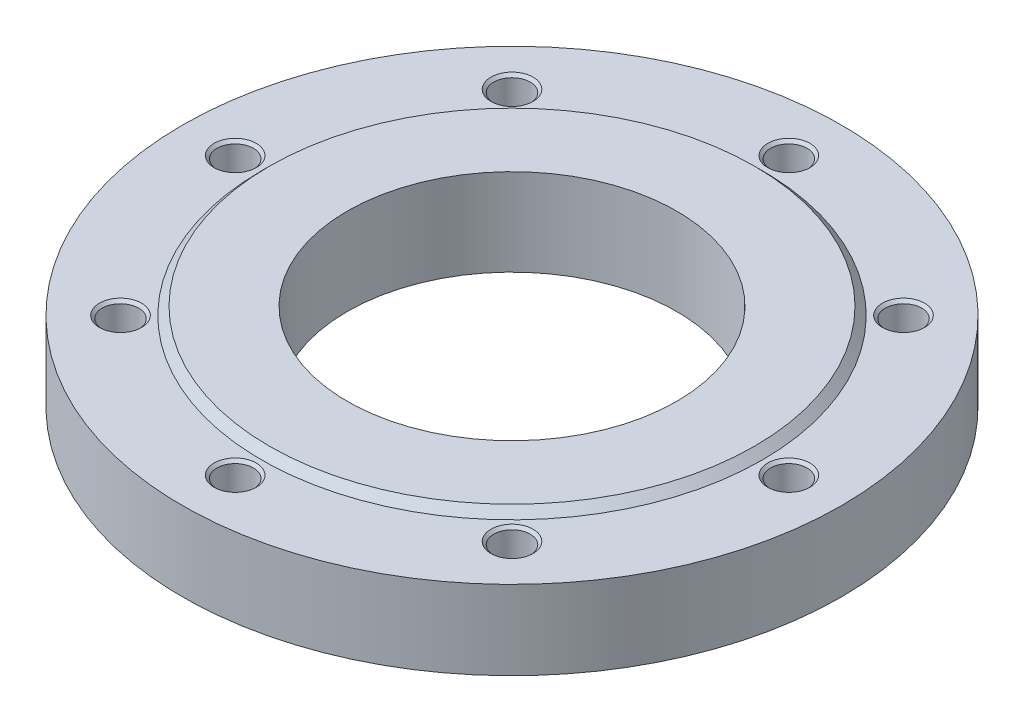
ISO-10303-21;
HEADER;
FILE_DESCRIPTION(('STEP AP214'),'2;1');
FILE_NAME('part.step','',(''),(''),'','','');
FILE_SCHEMA(('AUTOMOTIVE_DESIGN { 1 0 10303 214 1 1 1 1 }'));
ENDSEC;
DATA;
#1=APPLICATION_CONTEXT('core data for automotive mechanical design processes');
#2=APPLICATION_PROTOCOL_DEFINITION('international standard','automotive_design',2000,#1);
#3=PRODUCT_CONTEXT('',#1,'mechanical');
#4=PRODUCT('Part','Part','',(#3));
#5=PRODUCT_RELATED_PRODUCT_CATEGORY('part','',(#4));
#6=PRODUCT_DEFINITION_FORMATION('','',#4);
#7=PRODUCT_DEFINITION_CONTEXT('part definition',#1,'design');
#8=PRODUCT_DEFINITION('design','',#6,#7);
#9=PRODUCT_DEFINITION_SHAPE('','',#8);
#10=(LENGTH_UNIT() NAMED_UNIT(*) SI_UNIT(.MILLI.,.METRE.));
#11=(NAMED_UNIT(*) PLANE_ANGLE_UNIT() SI_UNIT($,.RADIAN.));
#12=(NAMED_UNIT(*) SI_UNIT($,.STERADIAN.) SOLID_ANGLE_UNIT());
#13=UNCERTAINTY_MEASURE_WITH_UNIT(LENGTH_MEASURE(1.E-05),#10,'distance_accuracy_value','');
#14=(GEOMETRIC_REPRESENTATION_CONTEXT(3) GLOBAL_UNCERTAINTY_ASSIGNED_CONTEXT((#13)) GLOBAL_UNIT_ASSIGNED_CONTEXT((#10,
#11,#12)) REPRESENTATION_CONTEXT('',''));
#15=CARTESIAN_POINT('',(0.,0.,0.));
#16=DIRECTION('',(0.,0.,1.));
#17=DIRECTION('',(1.,0.,0.));
#18=AXIS2_PLACEMENT_3D('',#15,#16,#17);
#19=CARTESIAN_POINT('',(0.,15.,0.));
#20=DIRECTION('',(0.,-1.,0.));
#21=DIRECTION('',(1.,0.,0.));
#22=AXIS2_PLACEMENT_3D('',#19,#20,#21);
#23=CYLINDRICAL_SURFACE('',#22,125.);
#24=CARTESIAN_POINT('',(0.,0.,0.));
#25=DIRECTION('',(0.,1.,0.));
#26=DIRECTION('',(1.,0.,0.));
#27=AXIS2_PLACEMENT_3D('',#24,#25,#26);
#28=CIRCLE('',#27,125.);
#29=CARTESIAN_POINT('',(125.,0.,0.));
#30=VERTEX_POINT('',#29);
#31=EDGE_CURVE('E9',#30,#30,#28,.T.);
#32=ORIENTED_EDGE('',*,*,#31,.T.);
#33=EDGE_LOOP('',(#32));
#34=FACE_BOUND('',#33,.T.);
#35=CARTESIAN_POINT('',(0.,30.,0.));
#36=DIRECTION('',(0.,1.,0.));
#37=DIRECTION('',(1.,0.,0.));
#38=AXIS2_PLACEMENT_3D('',#35,#36,#37);
#39=CIRCLE('',#38,125.);
#40=CARTESIAN_POINT('',(125.,30.,0.));
#41=VERTEX_POINT('',#40);
#42=EDGE_CURVE('E313',#41,#41,#39,.T.);
#43=ORIENTED_EDGE('',*,*,#42,.F.);
#44=EDGE_LOOP('',(#43));
#45=FACE_BOUND('',#44,.T.);
#46=ADVANCED_FACE('F15',(#34,#45),#23,.T.);
#47=CARTESIAN_POINT('',(93.75,0.,0.));
#48=DIRECTION('',(0.,-1.,0.));
#49=DIRECTION('',(-1.,0.,0.));
#50=AXIS2_PLACEMENT_3D('',#47,#48,#49);
#51=PLANE('',#50);
#52=CARTESIAN_POINT('',(0.,0.,0.));
#53=DIRECTION('',(0.,1.,0.));
#54=DIRECTION('',(1.,0.,0.));
#55=AXIS2_PLACEMENT_3D('',#52,#53,#54);
#56=CIRCLE('',#55,62.5);
#57=CARTESIAN_POINT('',(62.5,0.,0.));
#58=VERTEX_POINT('',#57);
#59=EDGE_CURVE('E22',#58,#58,#56,.T.);
#60=ORIENTED_EDGE('',*,*,#59,.T.);
#61=EDGE_LOOP('',(#60));
#62=FACE_BOUND('',#61,.T.);
#63=ORIENTED_EDGE('',*,*,#31,.F.);
#64=EDGE_LOOP('',(#63));
#65=FACE_BOUND('',#64,.T.);
#66=ADVANCED_FACE('F335',(#62,#65),#51,.T.);
#67=CARTESIAN_POINT('',(0.,16.5,0.));
#68=DIRECTION('',(0.,-1.,0.));
#69=DIRECTION('',(1.,0.,0.));
#70=AXIS2_PLACEMENT_3D('',#67,#68,#69);
#71=CYLINDRICAL_SURFACE('',#70,62.5);
#72=CARTESIAN_POINT('',(0.,33.,0.));
#73=DIRECTION('',(0.,1.,0.));
#74=DIRECTION('',(1.,0.,0.));
#75=AXIS2_PLACEMENT_3D('',#72,#73,#74);
#76=CIRCLE('',#75,62.5);
#77=CARTESIAN_POINT('',(62.5,33.,0.));
#78=VERTEX_POINT('',#77);
#79=EDGE_CURVE('E317',#78,#78,#76,.T.);
#80=ORIENTED_EDGE('',*,*,#79,.T.);
#81=EDGE_LOOP('',(#80));
#82=FACE_BOUND('',#81,.T.);
#83=ORIENTED_EDGE('',*,*,#59,.F.);
#84=EDGE_LOOP('',(#83));
#85=FACE_BOUND('',#84,.T.);
#86=ADVANCED_FACE('F320',(#82,#85),#71,.F.);
#87=CARTESIAN_POINT('',(77.25,33.,0.));
#88=DIRECTION('',(0.,1.,0.));
#89=DIRECTION('',(1.,0.,0.));
#90=AXIS2_PLACEMENT_3D('',#87,#88,#89);
#91=PLANE('',#90);
#92=CARTESIAN_POINT('',(0.,33.,0.));
#93=DIRECTION('',(0.,1.,0.));
#94=DIRECTION('',(1.,0.,0.));
#95=AXIS2_PLACEMENT_3D('',#92,#93,#94);
#96=CIRCLE('',#95,92.);
#97=CARTESIAN_POINT('',(92.,33.,0.));
#98=VERTEX_POINT('',#97);
#99=EDGE_CURVE('E315',#98,#98,#96,.T.);
#100=ORIENTED_EDGE('',*,*,#99,.T.);
#101=EDGE_LOOP('',(#100));
#102=FACE_BOUND('',#101,.T.);
#103=ORIENTED_EDGE('',*,*,#79,.F.);
#104=EDGE_LOOP('',(#103));
#105=FACE_BOUND('',#104,.T.);
#106=ADVANCED_FACE('F323',(#102,#105),#91,.T.);
#107=CARTESIAN_POINT('',(0.,31.5,0.));
#108=DIRECTION('',(0.,-1.,0.));
#109=DIRECTION('',(1.,0.,0.));
#110=AXIS2_PLACEMENT_3D('',#107,#108,#109);
#111=CONICAL_SURFACE('',#110,93.5,0.785398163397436);
#112=CARTESIAN_POINT('',(0.,30.,0.));
#113=DIRECTION('',(0.,1.,0.));
#114=DIRECTION('',(1.,0.,0.));
#115=AXIS2_PLACEMENT_3D('',#112,#113,#114);
#116=CIRCLE('',#115,95.);
#117=CARTESIAN_POINT('',(95.,30.,0.));
#118=VERTEX_POINT('',#117);
#119=EDGE_CURVE('E289',#118,#118,#116,.T.);
#120=ORIENTED_EDGE('',*,*,#119,.T.);
#121=EDGE_LOOP('',(#120));
#122=FACE_BOUND('',#121,.T.);
#123=ORIENTED_EDGE('',*,*,#99,.F.);
#124=EDGE_LOOP('',(#123));
#125=FACE_BOUND('',#124,.T.);
#126=ADVANCED_FACE('F325',(#122,#125),#111,.T.);
#127=CARTESIAN_POINT('',(110.,30.,0.));
#128=DIRECTION('',(0.,1.,0.));
#129=DIRECTION('',(1.,0.,0.));
#130=AXIS2_PLACEMENT_3D('',#127,#128,#129);
#131=PLANE('',#130);
#132=ORIENTED_EDGE('',*,*,#42,.T.);
#133=EDGE_LOOP('',(#132));
#134=FACE_BOUND('',#133,.T.);
#135=ORIENTED_EDGE('',*,*,#119,.F.);
#136=EDGE_LOOP('',(#135));
#137=FACE_BOUND('',#136,.T.);
#138=CARTESIAN_POINT('',(105.,30.,0.));
#139=DIRECTION('',(0.,-1.,0.));
#140=DIRECTION('',(1.,0.,0.));
#141=AXIS2_PLACEMENT_3D('',#138,#139,#140);
#142=CIRCLE('',#141,8.);
#143=CARTESIAN_POINT('',(113.,30.,0.));
#144=VERTEX_POINT('',#143);
#145=EDGE_CURVE('E280',#144,#144,#142,.T.);
#146=ORIENTED_EDGE('',*,*,#145,.T.);
#147=EDGE_LOOP('',(#146));
#148=FACE_BOUND('',#147,.T.);
#149=CARTESIAN_POINT('',(74.2462120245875,30.,-74.2462120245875));
#150=DIRECTION('',(0.,-1.,0.));
#151=DIRECTION('',(0.707106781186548,0.,-0.707106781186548));
#152=AXIS2_PLACEMENT_3D('',#149,#150,#151);
#153=CIRCLE('',#152,8.);
#154=CARTESIAN_POINT('',(79.9030662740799,30.,-79.9030662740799));
#155=VERTEX_POINT('',#154);
#156=EDGE_CURVE('E225',#155,#155,#153,.T.);
#157=ORIENTED_EDGE('',*,*,#156,.T.);
#158=EDGE_LOOP('',(#157));
#159=FACE_BOUND('',#158,.T.);
#160=CARTESIAN_POINT('',(0.,30.,-105.));
#161=DIRECTION('',(0.,-1.,0.));
#162=DIRECTION('',(0.,0.,-1.));
#163=AXIS2_PLACEMENT_3D('',#160,#161,#162);
#164=CIRCLE('',#163,8.);
#165=CARTESIAN_POINT('',(0.,30.,-113.));
#166=VERTEX_POINT('',#165);
#167=EDGE_CURVE('E251',#166,#166,#164,.T.);
#168=ORIENTED_EDGE('',*,*,#167,.T.);
#169=EDGE_LOOP('',(#168));
#170=FACE_BOUND('',#169,.T.);
#171=CARTESIAN_POINT('',(-74.2462120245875,30.,-74.2462120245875));
#172=DIRECTION('',(0.,-1.,0.));
#173=DIRECTION('',(-0.707106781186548,0.,-0.707106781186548));
#174=AXIS2_PLACEMENT_3D('',#171,#172,#173);
#175=CIRCLE('',#174,8.);
#176=CARTESIAN_POINT('',(-79.9030662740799,30.,-79.9030662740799));
#177=VERTEX_POINT('',#176);
#178=EDGE_CURVE('E279',#177,#177,#175,.T.);
#179=ORIENTED_EDGE('',*,*,#178,.T.);
#180=EDGE_LOOP('',(#179));
#181=FACE_BOUND('',#180,.T.);
#182=CARTESIAN_POINT('',(-105.,30.,0.));
#183=DIRECTION('',(0.,-1.,0.));
#184=DIRECTION('',(-1.,0.,0.));
#185=AXIS2_PLACEMENT_3D('',#182,#183,#184);
#186=CIRCLE('',#185,8.);
#187=CARTESIAN_POINT('',(-113.,30.,0.));
#188=VERTEX_POINT('',#187);
#189=EDGE_CURVE('E263',#188,#188,#186,.T.);
#190=ORIENTED_EDGE('',*,*,#189,.T.);
#191=EDGE_LOOP('',(#190));
#192=FACE_BOUND('',#191,.T.);
#193=CARTESIAN_POINT('',(-74.2462120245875,30.,74.2462120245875));
#194=DIRECTION('',(0.,-1.,0.));
#195=DIRECTION('',(-0.707106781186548,0.,0.707106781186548));
#196=AXIS2_PLACEMENT_3D('',#193,#194,#195);
#197=CIRCLE('',#196,8.);
#198=CARTESIAN_POINT('',(-79.9030662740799,30.,79.9030662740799));
#199=VERTEX_POINT('',#198);
#200=EDGE_CURVE('E234',#199,#199,#197,.T.);
#201=ORIENTED_EDGE('',*,*,#200,.T.);
#202=EDGE_LOOP('',(#201));
#203=FACE_BOUND('',#202,.T.);
#204=CARTESIAN_POINT('',(0.,30.,105.));
#205=DIRECTION('',(0.,-1.,0.));
#206=DIRECTION('',(0.,0.,1.));
#207=AXIS2_PLACEMENT_3D('',#204,#205,#206);
#208=CIRCLE('',#207,8.);
#209=CARTESIAN_POINT('',(0.,30.,113.));
#210=VERTEX_POINT('',#209);
#211=EDGE_CURVE('E211',#210,#210,#208,.T.);
#212=ORIENTED_EDGE('',*,*,#211,.T.);
#213=EDGE_LOOP('',(#212));
#214=FACE_BOUND('',#213,.T.);
#215=CARTESIAN_POINT('',(74.2462120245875,30.,74.2462120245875));
#216=DIRECTION('',(0.,-1.,0.));
#217=DIRECTION('',(0.707106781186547,0.,0.707106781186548));
#218=AXIS2_PLACEMENT_3D('',#215,#216,#217);
#219=CIRCLE('',#218,8.);
#220=CARTESIAN_POINT('',(79.9030662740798,30.,79.9030662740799));
#221=VERTEX_POINT('',#220);
#222=EDGE_CURVE('E231',#221,#221,#219,.T.);
#223=ORIENTED_EDGE('',*,*,#222,.T.);
#224=EDGE_LOOP('',(#223));
#225=FACE_BOUND('',#224,.T.);
#226=ADVANCED_FACE('F212',(#134,#137,#148,#159,#170,#181,#192,#203,#214,#225),#131,.T.);
#227=CARTESIAN_POINT('',(105.,5.00308975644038,0.));
#228=DIRECTION('',(0.,1.,0.));
#229=DIRECTION('',(1.,0.,0.));
#230=AXIS2_PLACEMENT_3D('',#227,#228,#229);
#231=CONICAL_SURFACE('',#230,3.45875,1.0471975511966);
#232=CARTESIAN_POINT('',(105.,7.,0.));
#233=DIRECTION('',(0.,-1.,0.));
#234=DIRECTION('',(1.,0.,0.));
#235=AXIS2_PLACEMENT_3D('',#232,#233,#234);
#236=CIRCLE('',#235,6.9175);
#237=CARTESIAN_POINT('',(111.9175,7.,0.));
#238=VERTEX_POINT('',#237);
#239=EDGE_CURVE('E287',#238,#238,#236,.T.);
#240=ORIENTED_EDGE('',*,*,#239,.F.);
#241=EDGE_LOOP('',(#240));
#242=FACE_BOUND('',#241,.T.);
#243=CARTESIAN_POINT('',(105.,3.00617951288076,0.));
#244=VERTEX_POINT('',#243);
#245=VERTEX_LOOP('',#244);
#246=FACE_BOUND('',#245,.T.);
#247=ADVANCED_FACE('F346',(#242,#246),#231,.F.);
#248=CARTESIAN_POINT('',(105.,9.95875,0.));
#249=DIRECTION('',(0.,1.,0.));
#250=DIRECTION('',(1.,0.,0.));
#251=AXIS2_PLACEMENT_3D('',#248,#249,#250);
#252=CYLINDRICAL_SURFACE('',#251,6.9175);
#253=CARTESIAN_POINT('',(105.,12.9175,0.));
#254=DIRECTION('',(0.,-1.,0.));
#255=DIRECTION('',(1.,0.,0.));
#256=AXIS2_PLACEMENT_3D('',#253,#254,#255);
#257=CIRCLE('',#256,6.9175);
#258=CARTESIAN_POINT('',(111.9175,12.9175,0.));
#259=VERTEX_POINT('',#258);
#260=EDGE_CURVE('E290',#259,#259,#257,.T.);
#261=ORIENTED_EDGE('',*,*,#260,.F.);
#262=EDGE_LOOP('',(#261));
#263=FACE_BOUND('',#262,.T.);
#264=ORIENTED_EDGE('',*,*,#239,.T.);
#265=EDGE_LOOP('',(#264));
#266=FACE_BOUND('',#265,.T.);
#267=ADVANCED_FACE('F453',(#263,#266),#252,.F.);
#268=CARTESIAN_POINT('',(105.,13.45875,0.));
#269=DIRECTION('',(0.,1.,0.));
#270=DIRECTION('',(1.,0.,0.));
#271=AXIS2_PLACEMENT_3D('',#268,#269,#270);
#272=CONICAL_SURFACE('',#271,7.45875,0.785398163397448);
#273=CARTESIAN_POINT('',(105.,14.,0.));
#274=DIRECTION('',(0.,-1.,0.));
#275=DIRECTION('',(1.,0.,0.));
#276=AXIS2_PLACEMENT_3D('',#273,#274,#275);
#277=CIRCLE('',#276,8.);
#278=CARTESIAN_POINT('',(113.,14.,0.));
#279=VERTEX_POINT('',#278);
#280=EDGE_CURVE('E309',#279,#279,#277,.T.);
#281=ORIENTED_EDGE('',*,*,#280,.F.);
#282=EDGE_LOOP('',(#281));
#283=FACE_BOUND('',#282,.T.);
#284=ORIENTED_EDGE('',*,*,#260,.T.);
#285=EDGE_LOOP('',(#284));
#286=FACE_BOUND('',#285,.T.);
#287=ADVANCED_FACE('F456',(#283,#286),#272,.F.);
#288=CARTESIAN_POINT('',(112.45875,14.,0.));
#289=DIRECTION('',(0.,1.,0.));
#290=DIRECTION('',(-1.,0.,0.));
#291=AXIS2_PLACEMENT_3D('',#288,#289,#290);
#292=PLANE('',#291);
#293=CARTESIAN_POINT('',(105.,14.,0.));
#294=DIRECTION('',(0.,-1.,0.));
#295=DIRECTION('',(1.,0.,0.));
#296=AXIS2_PLACEMENT_3D('',#293,#294,#295);
#297=CIRCLE('',#296,6.9175);
#298=CARTESIAN_POINT('',(111.9175,14.,0.));
#299=VERTEX_POINT('',#298);
#300=EDGE_CURVE('E282',#299,#299,#297,.T.);
#301=ORIENTED_EDGE('',*,*,#300,.F.);
#302=EDGE_LOOP('',(#301));
#303=FACE_BOUND('',#302,.T.);
#304=ORIENTED_EDGE('',*,*,#280,.T.);
#305=EDGE_LOOP('',(#304));
#306=FACE_BOUND('',#305,.T.);
#307=ADVANCED_FACE('F505',(#303,#306),#292,.F.);
#308=CARTESIAN_POINT('',(105.,21.45875,0.));
#309=DIRECTION('',(0.,1.,0.));
#310=DIRECTION('',(1.,0.,0.));
#311=AXIS2_PLACEMENT_3D('',#308,#309,#310);
#312=CYLINDRICAL_SURFACE('',#311,6.9175);
#313=CARTESIAN_POINT('',(105.,28.9175,0.));
#314=DIRECTION('',(0.,-1.,0.));
#315=DIRECTION('',(1.,0.,0.));
#316=AXIS2_PLACEMENT_3D('',#313,#314,#315);
#317=CIRCLE('',#316,6.9175);
#318=CARTESIAN_POINT('',(111.9175,28.9175,0.));
#319=VERTEX_POINT('',#318);
#320=EDGE_CURVE('E274',#319,#319,#317,.T.);
#321=ORIENTED_EDGE('',*,*,#320,.F.);
#322=EDGE_LOOP('',(#321));
#323=FACE_BOUND('',#322,.T.);
#324=ORIENTED_EDGE('',*,*,#300,.T.);
#325=EDGE_LOOP('',(#324));
#326=FACE_BOUND('',#325,.T.);
#327=ADVANCED_FACE('F435',(#323,#326),#312,.F.);
#328=CARTESIAN_POINT('',(105.,29.45875,0.));
#329=DIRECTION('',(0.,1.,0.));
#330=DIRECTION('',(1.,0.,0.));
#331=AXIS2_PLACEMENT_3D('',#328,#329,#330);
#332=CONICAL_SURFACE('',#331,7.45875,0.785398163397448);
#333=ORIENTED_EDGE('',*,*,#145,.F.);
#334=EDGE_LOOP('',(#333));
#335=FACE_BOUND('',#334,.T.);
#336=ORIENTED_EDGE('',*,*,#320,.T.);
#337=EDGE_LOOP('',(#336));
#338=FACE_BOUND('',#337,.T.);
#339=ADVANCED_FACE('F431',(#335,#338),#332,.F.);
#340=CARTESIAN_POINT('',(74.2462120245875,5.00308975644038,-74.2462120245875));
#341=DIRECTION('',(0.,1.,0.));
#342=DIRECTION('',(0.707106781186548,0.,-0.707106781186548));
#343=AXIS2_PLACEMENT_3D('',#340,#341,#342);
#344=CONICAL_SURFACE('',#343,3.45875,1.0471975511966);
#345=CARTESIAN_POINT('',(74.2462120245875,7.,-74.2462120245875));
#346=DIRECTION('',(0.,-1.,0.));
#347=DIRECTION('',(0.707106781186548,0.,-0.707106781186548));
#348=AXIS2_PLACEMENT_3D('',#345,#346,#347);
#349=CIRCLE('',#348,6.9175);
#350=CARTESIAN_POINT('',(79.1376231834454,7.,-79.1376231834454));
#351=VERTEX_POINT('',#350);
#352=EDGE_CURVE('E272',#351,#351,#349,.T.);
#353=ORIENTED_EDGE('',*,*,#352,.F.);
#354=EDGE_LOOP('',(#353));
#355=FACE_BOUND('',#354,.T.);
#356=CARTESIAN_POINT('',(74.2462120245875,3.00617951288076,-74.2462120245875));
#357=VERTEX_POINT('',#356);
#358=VERTEX_LOOP('',#357);
#359=FACE_BOUND('',#358,.T.);
#360=ADVANCED_FACE('F434',(#355,#359),#344,.F.);
#361=CARTESIAN_POINT('',(74.2462120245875,9.95875,-74.2462120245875));
#362=DIRECTION('',(0.,1.,0.));
#363=DIRECTION('',(0.707106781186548,0.,-0.707106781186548));
#364=AXIS2_PLACEMENT_3D('',#361,#362,#363);
#365=CYLINDRICAL_SURFACE('',#364,6.9175);
#366=CARTESIAN_POINT('',(74.2462120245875,12.9175,-74.2462120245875));
#367=DIRECTION('',(0.,-1.,0.));
#368=DIRECTION('',(0.707106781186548,0.,-0.707106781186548));
#369=AXIS2_PLACEMENT_3D('',#366,#367,#368);
#370=CIRCLE('',#369,6.9175);
#371=CARTESIAN_POINT('',(79.1376231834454,12.9175,-79.1376231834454));
#372=VERTEX_POINT('',#371);
#373=EDGE_CURVE('E275',#372,#372,#370,.T.);
#374=ORIENTED_EDGE('',*,*,#373,.F.);
#375=EDGE_LOOP('',(#374));
#376=FACE_BOUND('',#375,.T.);
#377=ORIENTED_EDGE('',*,*,#352,.T.);
#378=EDGE_LOOP('',(#377));
#379=FACE_BOUND('',#378,.T.);
#380=ADVANCED_FACE('F495',(#376,#379),#365,.F.);
#381=CARTESIAN_POINT('',(74.2462120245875,13.45875,-74.2462120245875));
#382=DIRECTION('',(0.,1.,0.));
#383=DIRECTION('',(0.707106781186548,0.,-0.707106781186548));
#384=AXIS2_PLACEMENT_3D('',#381,#382,#383);
#385=CONICAL_SURFACE('',#384,7.45875,0.785398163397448);
#386=CARTESIAN_POINT('',(74.2462120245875,14.,-74.2462120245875));
#387=DIRECTION('',(0.,-1.,0.));
#388=DIRECTION('',(0.707106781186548,0.,-0.707106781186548));
#389=AXIS2_PLACEMENT_3D('',#386,#387,#388);
#390=CIRCLE('',#389,8.);
#391=CARTESIAN_POINT('',(79.9030662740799,14.,-79.9030662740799));
#392=VERTEX_POINT('',#391);
#393=EDGE_CURVE('E304',#392,#392,#390,.T.);
#394=ORIENTED_EDGE('',*,*,#393,.F.);
#395=EDGE_LOOP('',(#394));
#396=FACE_BOUND('',#395,.T.);
#397=ORIENTED_EDGE('',*,*,#373,.T.);
#398=EDGE_LOOP('',(#397));
#399=FACE_BOUND('',#398,.T.);
#400=ADVANCED_FACE('F491',(#396,#399),#385,.F.);
#401=CARTESIAN_POINT('',(79.5203447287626,14.,-79.5203447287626));
#402=DIRECTION('',(0.,1.,0.));
#403=DIRECTION('',(-0.707106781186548,0.,0.707106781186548));
#404=AXIS2_PLACEMENT_3D('',#401,#402,#403);
#405=PLANE('',#404);
#406=CARTESIAN_POINT('',(74.2462120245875,14.,-74.2462120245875));
#407=DIRECTION('',(0.,-1.,0.));
#408=DIRECTION('',(0.707106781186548,0.,-0.707106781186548));
#409=AXIS2_PLACEMENT_3D('',#406,#407,#408);
#410=CIRCLE('',#409,6.9175);
#411=CARTESIAN_POINT('',(79.1376231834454,14.,-79.1376231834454));
#412=VERTEX_POINT('',#411);
#413=EDGE_CURVE('E227',#412,#412,#410,.T.);
#414=ORIENTED_EDGE('',*,*,#413,.F.);
#415=EDGE_LOOP('',(#414));
#416=FACE_BOUND('',#415,.T.);
#417=ORIENTED_EDGE('',*,*,#393,.T.);
#418=EDGE_LOOP('',(#417));
#419=FACE_BOUND('',#418,.T.);
#420=ADVANCED_FACE('F409',(#416,#419),#405,.F.);
#421=CARTESIAN_POINT('',(74.2462120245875,21.45875,-74.2462120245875));
#422=DIRECTION('',(0.,1.,0.));
#423=DIRECTION('',(0.707106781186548,0.,-0.707106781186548));
#424=AXIS2_PLACEMENT_3D('',#421,#422,#423);
#425=CYLINDRICAL_SURFACE('',#424,6.9175);
#426=CARTESIAN_POINT('',(74.2462120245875,28.9175,-74.2462120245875));
#427=DIRECTION('',(0.,-1.,0.));
#428=DIRECTION('',(0.707106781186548,0.,-0.707106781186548));
#429=AXIS2_PLACEMENT_3D('',#426,#427,#428);
#430=CIRCLE('',#429,6.9175);
#431=CARTESIAN_POINT('',(79.1376231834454,28.9175,-79.1376231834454));
#432=VERTEX_POINT('',#431);
#433=EDGE_CURVE('E228',#432,#432,#430,.T.);
#434=ORIENTED_EDGE('',*,*,#433,.F.);
#435=EDGE_LOOP('',(#434));
#436=FACE_BOUND('',#435,.T.);
#437=ORIENTED_EDGE('',*,*,#413,.T.);
#438=EDGE_LOOP('',(#437));
#439=FACE_BOUND('',#438,.T.);
#440=ADVANCED_FACE('F405',(#436,#439),#425,.F.);
#441=CARTESIAN_POINT('',(74.2462120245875,29.45875,-74.2462120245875));
#442=DIRECTION('',(0.,1.,0.));
#443=DIRECTION('',(0.707106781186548,0.,-0.707106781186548));
#444=AXIS2_PLACEMENT_3D('',#441,#442,#443);
#445=CONICAL_SURFACE('',#444,7.45875,0.785398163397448);
#446=ORIENTED_EDGE('',*,*,#156,.F.);
#447=EDGE_LOOP('',(#446));
#448=FACE_BOUND('',#447,.T.);
#449=ORIENTED_EDGE('',*,*,#433,.T.);
#450=EDGE_LOOP('',(#449));
#451=FACE_BOUND('',#450,.T.);
#452=ADVANCED_FACE('F408',(#448,#451),#445,.F.);
#453=CARTESIAN_POINT('',(0.,5.00308975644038,-105.));
#454=DIRECTION('',(0.,1.,0.));
#455=DIRECTION('',(0.,0.,-1.));
#456=AXIS2_PLACEMENT_3D('',#453,#454,#455);
#457=CONICAL_SURFACE('',#456,3.45875,1.0471975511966);
#458=CARTESIAN_POINT('',(0.,7.,-105.));
#459=DIRECTION('',(0.,-1.,0.));
#460=DIRECTION('',(0.,0.,-1.));
#461=AXIS2_PLACEMENT_3D('',#458,#459,#460);
#462=CIRCLE('',#461,6.9175);
#463=CARTESIAN_POINT('',(0.,7.,-111.9175));
#464=VERTEX_POINT('',#463);
#465=EDGE_CURVE('E261',#464,#464,#462,.T.);
#466=ORIENTED_EDGE('',*,*,#465,.F.);
#467=EDGE_LOOP('',(#466));
#468=FACE_BOUND('',#467,.T.);
#469=CARTESIAN_POINT('',(0.,3.00617951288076,-105.));
#470=VERTEX_POINT('',#469);
#471=VERTEX_LOOP('',#470);
#472=FACE_BOUND('',#471,.T.);
#473=ADVANCED_FACE('F481',(#468,#472),#457,.F.);
#474=CARTESIAN_POINT('',(0.,9.95875,-105.));
#475=DIRECTION('',(0.,1.,0.));
#476=DIRECTION('',(0.,0.,-1.));
#477=AXIS2_PLACEMENT_3D('',#474,#475,#476);
#478=CYLINDRICAL_SURFACE('',#477,6.9175);
#479=CARTESIAN_POINT('',(0.,12.9175,-105.));
#480=DIRECTION('',(0.,-1.,0.));
#481=DIRECTION('',(0.,0.,-1.));
#482=AXIS2_PLACEMENT_3D('',#479,#480,#481);
#483=CIRCLE('',#482,6.9175);
#484=CARTESIAN_POINT('',(0.,12.9175,-111.9175));
#485=VERTEX_POINT('',#484);
#486=EDGE_CURVE('E300',#485,#485,#483,.T.);
#487=ORIENTED_EDGE('',*,*,#486,.F.);
#488=EDGE_LOOP('',(#487));
#489=FACE_BOUND('',#488,.T.);
#490=ORIENTED_EDGE('',*,*,#465,.T.);
#491=EDGE_LOOP('',(#490));
#492=FACE_BOUND('',#491,.T.);
#493=ADVANCED_FACE('F478',(#489,#492),#478,.F.);
#494=CARTESIAN_POINT('',(0.,13.45875,-105.));
#495=DIRECTION('',(0.,1.,0.));
#496=DIRECTION('',(0.,0.,-1.));
#497=AXIS2_PLACEMENT_3D('',#494,#495,#496);
#498=CONICAL_SURFACE('',#497,7.45875,0.785398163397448);
#499=CARTESIAN_POINT('',(0.,14.,-105.));
#500=DIRECTION('',(0.,-1.,0.));
#501=DIRECTION('',(0.,0.,-1.));
#502=AXIS2_PLACEMENT_3D('',#499,#500,#501);
#503=CIRCLE('',#502,8.);
#504=CARTESIAN_POINT('',(0.,14.,-113.));
#505=VERTEX_POINT('',#504);
#506=EDGE_CURVE('E250',#505,#505,#503,.T.);
#507=ORIENTED_EDGE('',*,*,#506,.F.);
#508=EDGE_LOOP('',(#507));
#509=FACE_BOUND('',#508,.T.);
#510=ORIENTED_EDGE('',*,*,#486,.T.);
#511=EDGE_LOOP('',(#510));
#512=FACE_BOUND('',#511,.T.);
#513=ADVANCED_FACE('F476',(#509,#512),#498,.F.);
#514=CARTESIAN_POINT('',(0.,14.,-112.45875));
#515=DIRECTION('',(0.,1.,0.));
#516=DIRECTION('',(0.,0.,1.));
#517=AXIS2_PLACEMENT_3D('',#514,#515,#516);
#518=PLANE('',#517);
#519=CARTESIAN_POINT('',(0.,14.,-105.));
#520=DIRECTION('',(0.,-1.,0.));
#521=DIRECTION('',(0.,0.,-1.));
#522=AXIS2_PLACEMENT_3D('',#519,#520,#521);
#523=CIRCLE('',#522,6.9175);
#524=CARTESIAN_POINT('',(0.,14.,-111.9175));
#525=VERTEX_POINT('',#524);
#526=EDGE_CURVE('E248',#525,#525,#523,.T.);
#527=ORIENTED_EDGE('',*,*,#526,.F.);
#528=EDGE_LOOP('',(#527));
#529=FACE_BOUND('',#528,.T.);
#530=ORIENTED_EDGE('',*,*,#506,.T.);
#531=EDGE_LOOP('',(#530));
#532=FACE_BOUND('',#531,.T.);
#533=ADVANCED_FACE('F472',(#529,#532),#518,.F.);
#534=CARTESIAN_POINT('',(0.,21.45875,-105.));
#535=DIRECTION('',(0.,1.,0.));
#536=DIRECTION('',(0.,0.,-1.));
#537=AXIS2_PLACEMENT_3D('',#534,#535,#536);
#538=CYLINDRICAL_SURFACE('',#537,6.9175);
#539=CARTESIAN_POINT('',(0.,28.9175,-105.));
#540=DIRECTION('',(0.,-1.,0.));
#541=DIRECTION('',(0.,0.,-1.));
#542=AXIS2_PLACEMENT_3D('',#539,#540,#541);
#543=CIRCLE('',#542,6.9175);
#544=CARTESIAN_POINT('',(0.,28.9175,-111.9175));
#545=VERTEX_POINT('',#544);
#546=EDGE_CURVE('E296',#545,#545,#543,.T.);
#547=ORIENTED_EDGE('',*,*,#546,.F.);
#548=EDGE_LOOP('',(#547));
#549=FACE_BOUND('',#548,.T.);
#550=ORIENTED_EDGE('',*,*,#526,.T.);
#551=EDGE_LOOP('',(#550));
#552=FACE_BOUND('',#551,.T.);
#553=ADVANCED_FACE('F468',(#549,#552),#538,.F.);
#554=CARTESIAN_POINT('',(0.,29.45875,-105.));
#555=DIRECTION('',(0.,1.,0.));
#556=DIRECTION('',(0.,0.,-1.));
#557=AXIS2_PLACEMENT_3D('',#554,#555,#556);
#558=CONICAL_SURFACE('',#557,7.45875,0.785398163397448);
#559=ORIENTED_EDGE('',*,*,#167,.F.);
#560=EDGE_LOOP('',(#559));
#561=FACE_BOUND('',#560,.T.);
#562=ORIENTED_EDGE('',*,*,#546,.T.);
#563=EDGE_LOOP('',(#562));
#564=FACE_BOUND('',#563,.T.);
#565=ADVANCED_FACE('F464',(#561,#564),#558,.F.);
#566=CARTESIAN_POINT('',(-74.2462120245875,5.00308975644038,-74.2462120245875));
#567=DIRECTION('',(0.,1.,0.));
#568=DIRECTION('',(-0.707106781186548,0.,-0.707106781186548));
#569=AXIS2_PLACEMENT_3D('',#566,#567,#568);
#570=CONICAL_SURFACE('',#569,3.45875,1.0471975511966);
#571=CARTESIAN_POINT('',(-74.2462120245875,7.,-74.2462120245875));
#572=DIRECTION('',(0.,-1.,0.));
#573=DIRECTION('',(-0.707106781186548,0.,-0.707106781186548));
#574=AXIS2_PLACEMENT_3D('',#571,#572,#573);
#575=CIRCLE('',#574,6.9175);
#576=CARTESIAN_POINT('',(-79.1376231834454,7.,-79.1376231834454));
#577=VERTEX_POINT('',#576);
#578=EDGE_CURVE('E294',#577,#577,#575,.T.);
#579=ORIENTED_EDGE('',*,*,#578,.F.);
#580=EDGE_LOOP('',(#579));
#581=FACE_BOUND('',#580,.T.);
#582=CARTESIAN_POINT('',(-74.2462120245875,3.00617951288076,-74.2462120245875));
#583=VERTEX_POINT('',#582);
#584=VERTEX_LOOP('',#583);
#585=FACE_BOUND('',#584,.T.);
#586=ADVANCED_FACE('F460',(#581,#585),#570,.F.);
#587=CARTESIAN_POINT('',(-74.2462120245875,9.95875,-74.2462120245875));
#588=DIRECTION('',(0.,1.,0.));
#589=DIRECTION('',(-0.707106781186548,0.,-0.707106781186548));
#590=AXIS2_PLACEMENT_3D('',#587,#588,#589);
#591=CYLINDRICAL_SURFACE('',#590,6.9175);
#592=CARTESIAN_POINT('',(-74.2462120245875,12.9175,-74.2462120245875));
#593=DIRECTION('',(0.,-1.,0.));
#594=DIRECTION('',(-0.707106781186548,0.,-0.707106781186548));
#595=AXIS2_PLACEMENT_3D('',#592,#593,#594);
#596=CIRCLE('',#595,6.9175);
#597=CARTESIAN_POINT('',(-79.1376231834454,12.9175,-79.1376231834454));
#598=VERTEX_POINT('',#597);
#599=EDGE_CURVE('E292',#598,#598,#596,.T.);
#600=ORIENTED_EDGE('',*,*,#599,.F.);
#601=EDGE_LOOP('',(#600));
#602=FACE_BOUND('',#601,.T.);
#603=ORIENTED_EDGE('',*,*,#578,.T.);
#604=EDGE_LOOP('',(#603));
#605=FACE_BOUND('',#604,.T.);
#606=ADVANCED_FACE('F451',(#602,#605),#591,.F.);
#607=CARTESIAN_POINT('',(-74.2462120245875,13.45875,-74.2462120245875));
#608=DIRECTION('',(0.,1.,0.));
#609=DIRECTION('',(-0.707106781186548,0.,-0.707106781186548));
#610=AXIS2_PLACEMENT_3D('',#607,#608,#609);
#611=CONICAL_SURFACE('',#610,7.45875,0.785398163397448);
#612=CARTESIAN_POINT('',(-74.2462120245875,14.,-74.2462120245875));
#613=DIRECTION('',(0.,-1.,0.));
#614=DIRECTION('',(-0.707106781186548,0.,-0.707106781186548));
#615=AXIS2_PLACEMENT_3D('',#612,#613,#614);
#616=CIRCLE('',#615,8.);
#617=CARTESIAN_POINT('',(-79.9030662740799,14.,-79.9030662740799));
#618=VERTEX_POINT('',#617);
#619=EDGE_CURVE('E286',#618,#618,#616,.T.);
#620=ORIENTED_EDGE('',*,*,#619,.F.);
#621=EDGE_LOOP('',(#620));
#622=FACE_BOUND('',#621,.T.);
#623=ORIENTED_EDGE('',*,*,#599,.T.);
#624=EDGE_LOOP('',(#623));
#625=FACE_BOUND('',#624,.T.);
#626=ADVANCED_FACE('F447',(#622,#625),#611,.F.);
#627=CARTESIAN_POINT('',(-79.5203447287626,14.,-79.5203447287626));
#628=DIRECTION('',(0.,1.,0.));
#629=DIRECTION('',(0.707106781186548,0.,0.707106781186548));
#630=AXIS2_PLACEMENT_3D('',#627,#628,#629);
#631=PLANE('',#630);
#632=CARTESIAN_POINT('',(-74.2462120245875,14.,-74.2462120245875));
#633=DIRECTION('',(0.,-1.,0.));
#634=DIRECTION('',(-0.707106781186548,0.,-0.707106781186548));
#635=AXIS2_PLACEMENT_3D('',#632,#633,#634);
#636=CIRCLE('',#635,6.9175);
#637=CARTESIAN_POINT('',(-79.1376231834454,14.,-79.1376231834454));
#638=VERTEX_POINT('',#637);
#639=EDGE_CURVE('E284',#638,#638,#636,.T.);
#640=ORIENTED_EDGE('',*,*,#639,.F.);
#641=EDGE_LOOP('',(#640));
#642=FACE_BOUND('',#641,.T.);
#643=ORIENTED_EDGE('',*,*,#619,.T.);
#644=EDGE_LOOP('',(#643));
#645=FACE_BOUND('',#644,.T.);
#646=ADVANCED_FACE('F443',(#642,#645),#631,.F.);
#647=CARTESIAN_POINT('',(-74.2462120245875,21.45875,-74.2462120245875));
#648=DIRECTION('',(0.,1.,0.));
#649=DIRECTION('',(-0.707106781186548,0.,-0.707106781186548));
#650=AXIS2_PLACEMENT_3D('',#647,#648,#649);
#651=CYLINDRICAL_SURFACE('',#650,6.9175);
#652=CARTESIAN_POINT('',(-74.2462120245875,28.9175,-74.2462120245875));
#653=DIRECTION('',(0.,-1.,0.));
#654=DIRECTION('',(-0.707106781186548,0.,-0.707106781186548));
#655=AXIS2_PLACEMENT_3D('',#652,#653,#654);
#656=CIRCLE('',#655,6.9175);
#657=CARTESIAN_POINT('',(-79.1376231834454,28.9175,-79.1376231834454));
#658=VERTEX_POINT('',#657);
#659=EDGE_CURVE('E277',#658,#658,#656,.T.);
#660=ORIENTED_EDGE('',*,*,#659,.F.);
#661=EDGE_LOOP('',(#660));
#662=FACE_BOUND('',#661,.T.);
#663=ORIENTED_EDGE('',*,*,#639,.T.);
#664=EDGE_LOOP('',(#663));
#665=FACE_BOUND('',#664,.T.);
#666=ADVANCED_FACE('F439',(#662,#665),#651,.F.);
#667=CARTESIAN_POINT('',(-74.2462120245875,29.45875,-74.2462120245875));
#668=DIRECTION('',(0.,1.,0.));
#669=DIRECTION('',(-0.707106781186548,0.,-0.707106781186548));
#670=AXIS2_PLACEMENT_3D('',#667,#668,#669);
#671=CONICAL_SURFACE('',#670,7.45875,0.785398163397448);
#672=ORIENTED_EDGE('',*,*,#178,.F.);
#673=EDGE_LOOP('',(#672));
#674=FACE_BOUND('',#673,.T.);
#675=ORIENTED_EDGE('',*,*,#659,.T.);
#676=EDGE_LOOP('',(#675));
#677=FACE_BOUND('',#676,.T.);
#678=ADVANCED_FACE('F429',(#674,#677),#671,.F.);
#679=CARTESIAN_POINT('',(-105.,5.00308975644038,0.));
#680=DIRECTION('',(0.,1.,0.));
#681=DIRECTION('',(-1.,0.,0.));
#682=AXIS2_PLACEMENT_3D('',#679,#680,#681);
#683=CONICAL_SURFACE('',#682,3.45875,1.0471975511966);
#684=CARTESIAN_POINT('',(-105.,7.,0.));
#685=DIRECTION('',(0.,-1.,0.));
#686=DIRECTION('',(-1.,0.,0.));
#687=AXIS2_PLACEMENT_3D('',#684,#685,#686);
#688=CIRCLE('',#687,6.9175);
#689=CARTESIAN_POINT('',(-111.9175,7.,0.));
#690=VERTEX_POINT('',#689);
#691=EDGE_CURVE('E271',#690,#690,#688,.T.);
#692=ORIENTED_EDGE('',*,*,#691,.F.);
#693=EDGE_LOOP('',(#692));
#694=FACE_BOUND('',#693,.T.);
#695=CARTESIAN_POINT('',(-105.,3.00617951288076,0.));
#696=VERTEX_POINT('',#695);
#697=VERTEX_LOOP('',#696);
#698=FACE_BOUND('',#697,.T.);
#699=ADVANCED_FACE('F425',(#694,#698),#683,.F.);
#700=CARTESIAN_POINT('',(-105.,9.95875,0.));
#701=DIRECTION('',(0.,1.,0.));
#702=DIRECTION('',(-1.,0.,0.));
#703=AXIS2_PLACEMENT_3D('',#700,#701,#702);
#704=CYLINDRICAL_SURFACE('',#703,6.9175);
#705=CARTESIAN_POINT('',(-105.,12.9175,0.));
#706=DIRECTION('',(0.,-1.,0.));
#707=DIRECTION('',(-1.,0.,0.));
#708=AXIS2_PLACEMENT_3D('',#705,#706,#707);
#709=CIRCLE('',#708,6.9175);
#710=CARTESIAN_POINT('',(-111.9175,12.9175,0.));
#711=VERTEX_POINT('',#710);
#712=EDGE_CURVE('E269',#711,#711,#709,.T.);
#713=ORIENTED_EDGE('',*,*,#712,.F.);
#714=EDGE_LOOP('',(#713));
#715=FACE_BOUND('',#714,.T.);
#716=ORIENTED_EDGE('',*,*,#691,.T.);
#717=EDGE_LOOP('',(#716));
#718=FACE_BOUND('',#717,.T.);
#719=ADVANCED_FACE('F421',(#715,#718),#704,.F.);
#720=CARTESIAN_POINT('',(-105.,13.45875,0.));
#721=DIRECTION('',(0.,1.,0.));
#722=DIRECTION('',(-1.,0.,0.));
#723=AXIS2_PLACEMENT_3D('',#720,#721,#722);
#724=CONICAL_SURFACE('',#723,7.45875,0.785398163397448);
#725=CARTESIAN_POINT('',(-105.,14.,0.));
#726=DIRECTION('',(0.,-1.,0.));
#727=DIRECTION('',(-1.,0.,0.));
#728=AXIS2_PLACEMENT_3D('',#725,#726,#727);
#729=CIRCLE('',#728,8.);
#730=CARTESIAN_POINT('',(-113.,14.,0.));
#731=VERTEX_POINT('',#730);
#732=EDGE_CURVE('E267',#731,#731,#729,.T.);
#733=ORIENTED_EDGE('',*,*,#732,.F.);
#734=EDGE_LOOP('',(#733));
#735=FACE_BOUND('',#734,.T.);
#736=ORIENTED_EDGE('',*,*,#712,.T.);
#737=EDGE_LOOP('',(#736));
#738=FACE_BOUND('',#737,.T.);
#739=ADVANCED_FACE('F417',(#735,#738),#724,.F.);
#740=CARTESIAN_POINT('',(-112.45875,14.,0.));
#741=DIRECTION('',(0.,1.,0.));
#742=DIRECTION('',(1.,0.,0.));
#743=AXIS2_PLACEMENT_3D('',#740,#741,#742);
#744=PLANE('',#743);
#745=CARTESIAN_POINT('',(-105.,14.,0.));
#746=DIRECTION('',(0.,-1.,0.));
#747=DIRECTION('',(-1.,0.,0.));
#748=AXIS2_PLACEMENT_3D('',#745,#746,#747);
#749=CIRCLE('',#748,6.9175);
#750=CARTESIAN_POINT('',(-111.9175,14.,0.));
#751=VERTEX_POINT('',#750);
#752=EDGE_CURVE('E265',#751,#751,#749,.T.);
#753=ORIENTED_EDGE('',*,*,#752,.F.);
#754=EDGE_LOOP('',(#753));
#755=FACE_BOUND('',#754,.T.);
#756=ORIENTED_EDGE('',*,*,#732,.T.);
#757=EDGE_LOOP('',(#756));
#758=FACE_BOUND('',#757,.T.);
#759=ADVANCED_FACE('F413',(#755,#758),#744,.F.);
#760=CARTESIAN_POINT('',(-105.,21.45875,0.));
#761=DIRECTION('',(0.,1.,0.));
#762=DIRECTION('',(-1.,0.,0.));
#763=AXIS2_PLACEMENT_3D('',#760,#761,#762);
#764=CYLINDRICAL_SURFACE('',#763,6.9175);
#765=CARTESIAN_POINT('',(-105.,28.9175,0.));
#766=DIRECTION('',(0.,-1.,0.));
#767=DIRECTION('',(-1.,0.,0.));
#768=AXIS2_PLACEMENT_3D('',#765,#766,#767);
#769=CIRCLE('',#768,6.9175);
#770=CARTESIAN_POINT('',(-111.9175,28.9175,0.));
#771=VERTEX_POINT('',#770);
#772=EDGE_CURVE('E259',#771,#771,#769,.T.);
#773=ORIENTED_EDGE('',*,*,#772,.F.);
#774=EDGE_LOOP('',(#773));
#775=FACE_BOUND('',#774,.T.);
#776=ORIENTED_EDGE('',*,*,#752,.T.);
#777=EDGE_LOOP('',(#776));
#778=FACE_BOUND('',#777,.T.);
#779=ADVANCED_FACE('F401',(#775,#778),#764,.F.);
#780=CARTESIAN_POINT('',(-105.,29.45875,0.));
#781=DIRECTION('',(0.,1.,0.));
#782=DIRECTION('',(-1.,0.,0.));
#783=AXIS2_PLACEMENT_3D('',#780,#781,#782);
#784=CONICAL_SURFACE('',#783,7.45875,0.785398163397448);
#785=ORIENTED_EDGE('',*,*,#189,.F.);
#786=EDGE_LOOP('',(#785));
#787=FACE_BOUND('',#786,.T.);
#788=ORIENTED_EDGE('',*,*,#772,.T.);
#789=EDGE_LOOP('',(#788));
#790=FACE_BOUND('',#789,.T.);
#791=ADVANCED_FACE('F396',(#787,#790),#784,.F.);
#792=CARTESIAN_POINT('',(-74.2462120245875,5.00308975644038,74.2462120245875));
#793=DIRECTION('',(0.,1.,0.));
#794=DIRECTION('',(-0.707106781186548,0.,0.707106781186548));
#795=AXIS2_PLACEMENT_3D('',#792,#793,#794);
#796=CONICAL_SURFACE('',#795,3.45875,1.0471975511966);
#797=CARTESIAN_POINT('',(-74.2462120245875,7.,74.2462120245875));
#798=DIRECTION('',(0.,-1.,0.));
#799=DIRECTION('',(-0.707106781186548,0.,0.707106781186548));
#800=AXIS2_PLACEMENT_3D('',#797,#798,#799);
#801=CIRCLE('',#800,6.9175);
#802=CARTESIAN_POINT('',(-79.1376231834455,7.,79.1376231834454));
#803=VERTEX_POINT('',#802);
#804=EDGE_CURVE('E257',#803,#803,#801,.T.);
#805=ORIENTED_EDGE('',*,*,#804,.F.);
#806=EDGE_LOOP('',(#805));
#807=FACE_BOUND('',#806,.T.);
#808=CARTESIAN_POINT('',(-74.2462120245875,3.00617951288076,74.2462120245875));
#809=VERTEX_POINT('',#808);
#810=VERTEX_LOOP('',#809);
#811=FACE_BOUND('',#810,.T.);
#812=ADVANCED_FACE('F390',(#807,#811),#796,.F.);
#813=CARTESIAN_POINT('',(-74.2462120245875,9.95875,74.2462120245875));
#814=DIRECTION('',(0.,1.,0.));
#815=DIRECTION('',(-0.707106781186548,0.,0.707106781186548));
#816=AXIS2_PLACEMENT_3D('',#813,#814,#815);
#817=CYLINDRICAL_SURFACE('',#816,6.9175);
#818=CARTESIAN_POINT('',(-74.2462120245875,12.9175,74.2462120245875));
#819=DIRECTION('',(0.,-1.,0.));
#820=DIRECTION('',(-0.707106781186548,0.,0.707106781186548));
#821=AXIS2_PLACEMENT_3D('',#818,#819,#820);
#822=CIRCLE('',#821,6.9175);
#823=CARTESIAN_POINT('',(-79.1376231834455,12.9175,79.1376231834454));
#824=VERTEX_POINT('',#823);
#825=EDGE_CURVE('E255',#824,#824,#822,.T.);
#826=ORIENTED_EDGE('',*,*,#825,.F.);
#827=EDGE_LOOP('',(#826));
#828=FACE_BOUND('',#827,.T.);
#829=ORIENTED_EDGE('',*,*,#804,.T.);
#830=EDGE_LOOP('',(#829));
#831=FACE_BOUND('',#830,.T.);
#832=ADVANCED_FACE('F384',(#828,#831),#817,.F.);
#833=CARTESIAN_POINT('',(-74.2462120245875,13.45875,74.2462120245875));
#834=DIRECTION('',(0.,1.,0.));
#835=DIRECTION('',(-0.707106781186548,0.,0.707106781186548));
#836=AXIS2_PLACEMENT_3D('',#833,#834,#835);
#837=CONICAL_SURFACE('',#836,7.45875,0.785398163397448);
#838=CARTESIAN_POINT('',(-74.2462120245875,14.,74.2462120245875));
#839=DIRECTION('',(0.,-1.,0.));
#840=DIRECTION('',(-0.707106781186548,0.,0.707106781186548));
#841=AXIS2_PLACEMENT_3D('',#838,#839,#840);
#842=CIRCLE('',#841,8.);
#843=CARTESIAN_POINT('',(-79.9030662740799,14.,79.9030662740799));
#844=VERTEX_POINT('',#843);
#845=EDGE_CURVE('E253',#844,#844,#842,.T.);
#846=ORIENTED_EDGE('',*,*,#845,.F.);
#847=EDGE_LOOP('',(#846));
#848=FACE_BOUND('',#847,.T.);
#849=ORIENTED_EDGE('',*,*,#825,.T.);
#850=EDGE_LOOP('',(#849));
#851=FACE_BOUND('',#850,.T.);
#852=ADVANCED_FACE('F378',(#848,#851),#837,.F.);
#853=CARTESIAN_POINT('',(-79.5203447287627,14.,79.5203447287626));
#854=DIRECTION('',(0.,1.,0.));
#855=DIRECTION('',(0.707106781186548,0.,-0.707106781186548));
#856=AXIS2_PLACEMENT_3D('',#853,#854,#855);
#857=PLANE('',#856);
#858=CARTESIAN_POINT('',(-74.2462120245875,14.,74.2462120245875));
#859=DIRECTION('',(0.,-1.,0.));
#860=DIRECTION('',(-0.707106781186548,0.,0.707106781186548));
#861=AXIS2_PLACEMENT_3D('',#858,#859,#860);
#862=CIRCLE('',#861,6.9175);
#863=CARTESIAN_POINT('',(-79.1376231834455,14.,79.1376231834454));
#864=VERTEX_POINT('',#863);
#865=EDGE_CURVE('E236',#864,#864,#862,.T.);
#866=ORIENTED_EDGE('',*,*,#865,.F.);
#867=EDGE_LOOP('',(#866));
#868=FACE_BOUND('',#867,.T.);
#869=ORIENTED_EDGE('',*,*,#845,.T.);
#870=EDGE_LOOP('',(#869));
#871=FACE_BOUND('',#870,.T.);
#872=ADVANCED_FACE('F372',(#868,#871),#857,.F.);
#873=CARTESIAN_POINT('',(-74.2462120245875,21.45875,74.2462120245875));
#874=DIRECTION('',(0.,1.,0.));
#875=DIRECTION('',(-0.707106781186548,0.,0.707106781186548));
#876=AXIS2_PLACEMENT_3D('',#873,#874,#875);
#877=CYLINDRICAL_SURFACE('',#876,6.9175);
#878=CARTESIAN_POINT('',(-74.2462120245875,28.9175,74.2462120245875));
#879=DIRECTION('',(0.,-1.,0.));
#880=DIRECTION('',(-0.707106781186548,0.,0.707106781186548));
#881=AXIS2_PLACEMENT_3D('',#878,#879,#880);
#882=CIRCLE('',#881,6.9175);
#883=CARTESIAN_POINT('',(-79.1376231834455,28.9175,79.1376231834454));
#884=VERTEX_POINT('',#883);
#885=EDGE_CURVE('E237',#884,#884,#882,.T.);
#886=ORIENTED_EDGE('',*,*,#885,.F.);
#887=EDGE_LOOP('',(#886));
#888=FACE_BOUND('',#887,.T.);
#889=ORIENTED_EDGE('',*,*,#865,.T.);
#890=EDGE_LOOP('',(#889));
#891=FACE_BOUND('',#890,.T.);
#892=ADVANCED_FACE('F366',(#888,#891),#877,.F.);
#893=CARTESIAN_POINT('',(-74.2462120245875,29.45875,74.2462120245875));
#894=DIRECTION('',(0.,1.,0.));
#895=DIRECTION('',(-0.707106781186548,0.,0.707106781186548));
#896=AXIS2_PLACEMENT_3D('',#893,#894,#895);
#897=CONICAL_SURFACE('',#896,7.45875,0.785398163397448);
#898=ORIENTED_EDGE('',*,*,#200,.F.);
#899=EDGE_LOOP('',(#898));
#900=FACE_BOUND('',#899,.T.);
#901=ORIENTED_EDGE('',*,*,#885,.T.);
#902=EDGE_LOOP('',(#901));
#903=FACE_BOUND('',#902,.T.);
#904=ADVANCED_FACE('F362',(#900,#903),#897,.F.);
#905=CARTESIAN_POINT('',(0.,5.00308975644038,105.));
#906=DIRECTION('',(0.,1.,0.));
#907=DIRECTION('',(0.,0.,1.));
#908=AXIS2_PLACEMENT_3D('',#905,#906,#907);
#909=CONICAL_SURFACE('',#908,3.45875,1.0471975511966);
#910=CARTESIAN_POINT('',(0.,7.,105.));
#911=DIRECTION('',(0.,-1.,0.));
#912=DIRECTION('',(0.,0.,1.));
#913=AXIS2_PLACEMENT_3D('',#910,#911,#912);
#914=CIRCLE('',#913,6.9175);
#915=CARTESIAN_POINT('',(0.,7.,111.9175));
#916=VERTEX_POINT('',#915);
#917=EDGE_CURVE('E238',#916,#916,#914,.T.);
#918=ORIENTED_EDGE('',*,*,#917,.F.);
#919=EDGE_LOOP('',(#918));
#920=FACE_BOUND('',#919,.T.);
#921=CARTESIAN_POINT('',(0.,3.00617951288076,105.));
#922=VERTEX_POINT('',#921);
#923=VERTEX_LOOP('',#922);
#924=FACE_BOUND('',#923,.T.);
#925=ADVANCED_FACE('F365',(#920,#924),#909,.F.);
#926=CARTESIAN_POINT('',(0.,9.95875,105.));
#927=DIRECTION('',(0.,1.,0.));
#928=DIRECTION('',(0.,0.,1.));
#929=AXIS2_PLACEMENT_3D('',#926,#927,#928);
#930=CYLINDRICAL_SURFACE('',#929,6.9175);
#931=CARTESIAN_POINT('',(0.,12.9175,105.));
#932=DIRECTION('',(0.,-1.,0.));
#933=DIRECTION('',(0.,0.,1.));
#934=AXIS2_PLACEMENT_3D('',#931,#932,#933);
#935=CIRCLE('',#934,6.9175);
#936=CARTESIAN_POINT('',(0.,12.9175,111.9175));
#937=VERTEX_POINT('',#936);
#938=EDGE_CURVE('E239',#937,#937,#935,.T.);
#939=ORIENTED_EDGE('',*,*,#938,.F.);
#940=EDGE_LOOP('',(#939));
#941=FACE_BOUND('',#940,.T.);
#942=ORIENTED_EDGE('',*,*,#917,.T.);
#943=EDGE_LOOP('',(#942));
#944=FACE_BOUND('',#943,.T.);
#945=ADVANCED_FACE('F689',(#941,#944),#930,.F.);
#946=CARTESIAN_POINT('',(0.,13.45875,105.));
#947=DIRECTION('',(0.,1.,0.));
#948=DIRECTION('',(0.,0.,1.));
#949=AXIS2_PLACEMENT_3D('',#946,#947,#948);
#950=CONICAL_SURFACE('',#949,7.45875,0.785398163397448);
#951=CARTESIAN_POINT('',(0.,14.,105.));
#952=DIRECTION('',(0.,-1.,0.));
#953=DIRECTION('',(0.,0.,1.));
#954=AXIS2_PLACEMENT_3D('',#951,#952,#953);
#955=CIRCLE('',#954,8.);
#956=CARTESIAN_POINT('',(0.,14.,113.));
#957=VERTEX_POINT('',#956);
#958=EDGE_CURVE('E218',#957,#957,#955,.T.);
#959=ORIENTED_EDGE('',*,*,#958,.F.);
#960=EDGE_LOOP('',(#959));
#961=FACE_BOUND('',#960,.T.);
#962=ORIENTED_EDGE('',*,*,#938,.T.);
#963=EDGE_LOOP('',(#962));
#964=FACE_BOUND('',#963,.T.);
#965=ADVANCED_FACE('F699',(#961,#964),#950,.F.);
#966=CARTESIAN_POINT('',(0.,14.,112.45875));
#967=DIRECTION('',(0.,1.,0.));
#968=DIRECTION('',(0.,0.,-1.));
#969=AXIS2_PLACEMENT_3D('',#966,#967,#968);
#970=PLANE('',#969);
#971=CARTESIAN_POINT('',(0.,14.,105.));
#972=DIRECTION('',(0.,-1.,0.));
#973=DIRECTION('',(0.,0.,1.));
#974=AXIS2_PLACEMENT_3D('',#971,#972,#973);
#975=CIRCLE('',#974,6.9175);
#976=CARTESIAN_POINT('',(0.,14.,111.9175));
#977=VERTEX_POINT('',#976);
#978=EDGE_CURVE('E215',#977,#977,#975,.T.);
#979=ORIENTED_EDGE('',*,*,#978,.F.);
#980=EDGE_LOOP('',(#979));
#981=FACE_BOUND('',#980,.T.);
#982=ORIENTED_EDGE('',*,*,#958,.T.);
#983=EDGE_LOOP('',(#982));
#984=FACE_BOUND('',#983,.T.);
#985=ADVANCED_FACE('F709',(#981,#984),#970,.F.);
#986=CARTESIAN_POINT('',(0.,21.45875,105.));
#987=DIRECTION('',(0.,1.,0.));
#988=DIRECTION('',(0.,0.,1.));
#989=AXIS2_PLACEMENT_3D('',#986,#987,#988);
#990=CYLINDRICAL_SURFACE('',#989,6.9175);
#991=CARTESIAN_POINT('',(0.,28.9175,105.));
#992=DIRECTION('',(0.,-1.,0.));
#993=DIRECTION('',(0.,0.,1.));
#994=AXIS2_PLACEMENT_3D('',#991,#992,#993);
#995=CIRCLE('',#994,6.9175);
#996=CARTESIAN_POINT('',(0.,28.9175,111.9175));
#997=VERTEX_POINT('',#996);
#998=EDGE_CURVE('E216',#997,#997,#995,.T.);
#999=ORIENTED_EDGE('',*,*,#998,.F.);
#1000=EDGE_LOOP('',(#999));
#1001=FACE_BOUND('',#1000,.T.);
#1002=ORIENTED_EDGE('',*,*,#978,.T.);
#1003=EDGE_LOOP('',(#1002));
#1004=FACE_BOUND('',#1003,.T.);
#1005=ADVANCED_FACE('F719',(#1001,#1004),#990,.F.);
#1006=CARTESIAN_POINT('',(0.,29.45875,105.));
#1007=DIRECTION('',(0.,1.,0.));
#1008=DIRECTION('',(0.,0.,1.));
#1009=AXIS2_PLACEMENT_3D('',#1006,#1007,#1008);
#1010=CONICAL_SURFACE('',#1009,7.45875,0.785398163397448);
#1011=ORIENTED_EDGE('',*,*,#211,.F.);
#1012=EDGE_LOOP('',(#1011));
#1013=FACE_BOUND('',#1012,.T.);
#1014=ORIENTED_EDGE('',*,*,#998,.T.);
#1015=EDGE_LOOP('',(#1014));
#1016=FACE_BOUND('',#1015,.T.);
#1017=ADVANCED_FACE('F729',(#1013,#1016),#1010,.F.);
#1018=CARTESIAN_POINT('',(74.2462120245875,5.00308975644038,74.2462120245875));
#1019=DIRECTION('',(0.,1.,0.));
#1020=DIRECTION('',(0.707106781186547,0.,0.707106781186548));
#1021=AXIS2_PLACEMENT_3D('',#1018,#1019,#1020);
#1022=CONICAL_SURFACE('',#1021,3.45875,1.0471975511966);
#1023=CARTESIAN_POINT('',(74.2462120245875,7.,74.2462120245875));
#1024=DIRECTION('',(0.,-1.,0.));
#1025=DIRECTION('',(0.707106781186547,0.,0.707106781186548));
#1026=AXIS2_PLACEMENT_3D('',#1023,#1024,#1025);
#1027=CIRCLE('',#1026,6.9175);
#1028=CARTESIAN_POINT('',(79.1376231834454,7.,79.1376231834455));
#1029=VERTEX_POINT('',#1028);
#1030=EDGE_CURVE('E220',#1029,#1029,#1027,.T.);
#1031=ORIENTED_EDGE('',*,*,#1030,.F.);
#1032=EDGE_LOOP('',(#1031));
#1033=FACE_BOUND('',#1032,.T.);
#1034=CARTESIAN_POINT('',(74.2462120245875,3.00617951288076,74.2462120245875));
#1035=VERTEX_POINT('',#1034);
#1036=VERTEX_LOOP('',#1035);
#1037=FACE_BOUND('',#1036,.T.);
#1038=ADVANCED_FACE('F739',(#1033,#1037),#1022,.F.);
#1039=CARTESIAN_POINT('',(74.2462120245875,9.95875,74.2462120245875));
#1040=DIRECTION('',(0.,1.,0.));
#1041=DIRECTION('',(0.707106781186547,0.,0.707106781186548));
#1042=AXIS2_PLACEMENT_3D('',#1039,#1040,#1041);
#1043=CYLINDRICAL_SURFACE('',#1042,6.9175);
#1044=CARTESIAN_POINT('',(74.2462120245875,12.9175,74.2462120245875));
#1045=DIRECTION('',(0.,-1.,0.));
#1046=DIRECTION('',(0.707106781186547,0.,0.707106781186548));
#1047=AXIS2_PLACEMENT_3D('',#1044,#1045,#1046);
#1048=CIRCLE('',#1047,6.9175);
#1049=CARTESIAN_POINT('',(79.1376231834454,12.9175,79.1376231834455));
#1050=VERTEX_POINT('',#1049);
#1051=EDGE_CURVE('E224',#1050,#1050,#1048,.T.);
#1052=ORIENTED_EDGE('',*,*,#1051,.F.);
#1053=EDGE_LOOP('',(#1052));
#1054=FACE_BOUND('',#1053,.T.);
#1055=ORIENTED_EDGE('',*,*,#1030,.T.);
#1056=EDGE_LOOP('',(#1055));
#1057=FACE_BOUND('',#1056,.T.);
#1058=ADVANCED_FACE('F748',(#1054,#1057),#1043,.F.);
#1059=CARTESIAN_POINT('',(74.2462120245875,13.45875,74.2462120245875));
#1060=DIRECTION('',(0.,1.,0.));
#1061=DIRECTION('',(0.707106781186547,0.,0.707106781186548));
#1062=AXIS2_PLACEMENT_3D('',#1059,#1060,#1061);
#1063=CONICAL_SURFACE('',#1062,7.45875,0.785398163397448);
#1064=CARTESIAN_POINT('',(74.2462120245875,14.,74.2462120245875));
#1065=DIRECTION('',(0.,-1.,0.));
#1066=DIRECTION('',(0.707106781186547,0.,0.707106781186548));
#1067=AXIS2_PLACEMENT_3D('',#1064,#1065,#1066);
#1068=CIRCLE('',#1067,8.);
#1069=CARTESIAN_POINT('',(79.9030662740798,14.,79.9030662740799));
#1070=VERTEX_POINT('',#1069);
#1071=EDGE_CURVE('E242',#1070,#1070,#1068,.T.);
#1072=ORIENTED_EDGE('',*,*,#1071,.F.);
#1073=EDGE_LOOP('',(#1072));
#1074=FACE_BOUND('',#1073,.T.);
#1075=ORIENTED_EDGE('',*,*,#1051,.T.);
#1076=EDGE_LOOP('',(#1075));
#1077=FACE_BOUND('',#1076,.T.);
#1078=ADVANCED_FACE('F758',(#1074,#1077),#1063,.F.);
#1079=CARTESIAN_POINT('',(79.5203447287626,14.,79.5203447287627));
#1080=DIRECTION('',(0.,1.,0.));
#1081=DIRECTION('',(-0.707106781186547,0.,-0.707106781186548));
#1082=AXIS2_PLACEMENT_3D('',#1079,#1080,#1081);
#1083=PLANE('',#1082);
#1084=CARTESIAN_POINT('',(74.2462120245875,14.,74.2462120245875));
#1085=DIRECTION('',(0.,-1.,0.));
#1086=DIRECTION('',(0.707106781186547,0.,0.707106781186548));
#1087=AXIS2_PLACEMENT_3D('',#1084,#1085,#1086);
#1088=CIRCLE('',#1087,6.9175);
#1089=CARTESIAN_POINT('',(79.1376231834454,14.,79.1376231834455));
#1090=VERTEX_POINT('',#1089);
#1091=EDGE_CURVE('E233',#1090,#1090,#1088,.T.);
#1092=ORIENTED_EDGE('',*,*,#1091,.F.);
#1093=EDGE_LOOP('',(#1092));
#1094=FACE_BOUND('',#1093,.T.);
#1095=ORIENTED_EDGE('',*,*,#1071,.T.);
#1096=EDGE_LOOP('',(#1095));
#1097=FACE_BOUND('',#1096,.T.);
#1098=ADVANCED_FACE('F768',(#1094,#1097),#1083,.F.);
#1099=CARTESIAN_POINT('',(74.2462120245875,21.45875,74.2462120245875));
#1100=DIRECTION('',(0.,1.,0.));
#1101=DIRECTION('',(0.707106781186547,0.,0.707106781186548));
#1102=AXIS2_PLACEMENT_3D('',#1099,#1100,#1101);
#1103=CYLINDRICAL_SURFACE('',#1102,6.9175);
#1104=CARTESIAN_POINT('',(74.2462120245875,28.9175,74.2462120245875));
#1105=DIRECTION('',(0.,-1.,0.));
#1106=DIRECTION('',(0.707106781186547,0.,0.707106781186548));
#1107=AXIS2_PLACEMENT_3D('',#1104,#1105,#1106);
#1108=CIRCLE('',#1107,6.9175);
#1109=CARTESIAN_POINT('',(79.1376231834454,28.9175,79.1376231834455));
#1110=VERTEX_POINT('',#1109);
#1111=EDGE_CURVE('E229',#1110,#1110,#1108,.T.);
#1112=ORIENTED_EDGE('',*,*,#1111,.F.);
#1113=EDGE_LOOP('',(#1112));
#1114=FACE_BOUND('',#1113,.T.);
#1115=ORIENTED_EDGE('',*,*,#1091,.T.);
#1116=EDGE_LOOP('',(#1115));
#1117=FACE_BOUND('',#1116,.T.);
#1118=ADVANCED_FACE('F778',(#1114,#1117),#1103,.F.);
#1119=CARTESIAN_POINT('',(74.2462120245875,29.45875,74.2462120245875));
#1120=DIRECTION('',(0.,1.,0.));
#1121=DIRECTION('',(0.707106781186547,0.,0.707106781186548));
#1122=AXIS2_PLACEMENT_3D('',#1119,#1120,#1121);
#1123=CONICAL_SURFACE('',#1122,7.45875,0.785398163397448);
#1124=ORIENTED_EDGE('',*,*,#222,.F.);
#1125=EDGE_LOOP('',(#1124));
#1126=FACE_BOUND('',#1125,.T.);
#1127=ORIENTED_EDGE('',*,*,#1111,.T.);
#1128=EDGE_LOOP('',(#1127));
#1129=FACE_BOUND('',#1128,.T.);
#1130=ADVANCED_FACE('F788',(#1126,#1129),#1123,.F.);
#1131=CLOSED_SHELL('',(#46,#66,#86,#106,#126,#226,#247,#267,#287,#307,#327,#339,#360,#380,#400,
#420,#440,#452,#473,#493,#513,#533,#553,#565,#586,#606,#626,#646,#666,#678,#699,#719,#739,#759,
#779,#791,#812,#832,#852,#872,#892,#904,#925,#945,#965,#985,#1005,#1017,#1038,#1058,#1078,#1098,
#1118,#1130));
#1132=MANIFOLD_SOLID_BREP('B1',#1131);
#1133=ADVANCED_BREP_SHAPE_REPRESENTATION('',(#18,#1132),#14);
#1134=SHAPE_DEFINITION_REPRESENTATION(#9,#1133);
ENDSEC;
END-ISO-10303-21;
